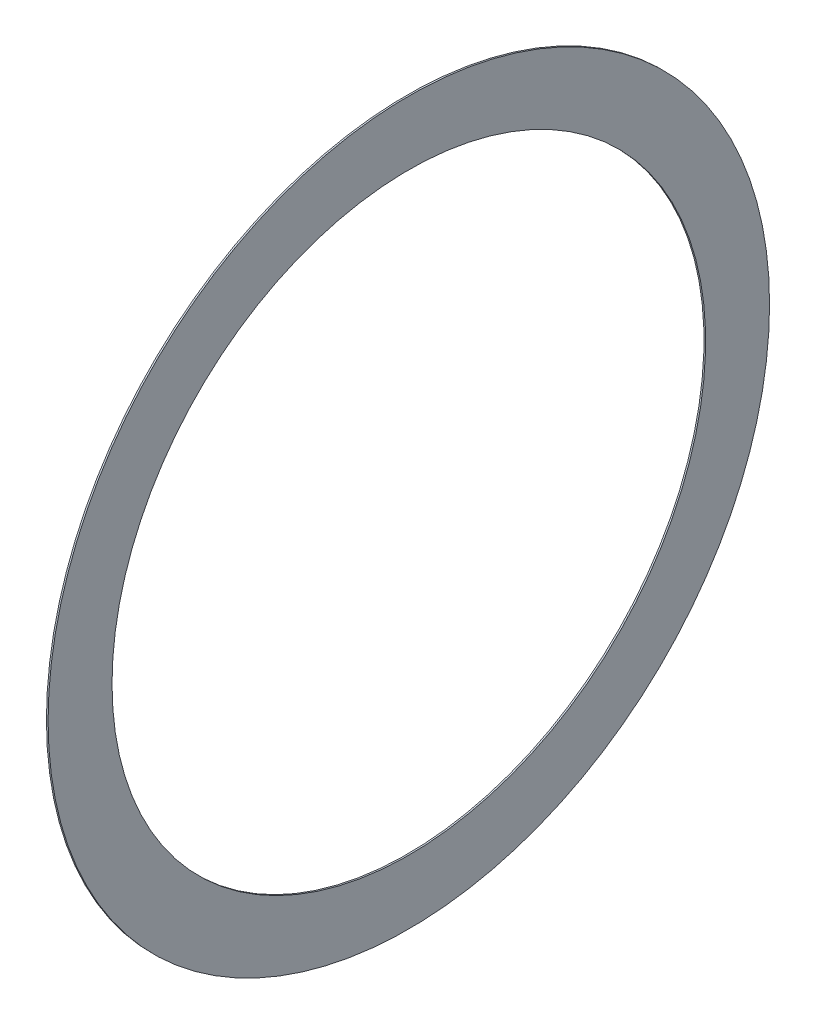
from build123d import *

# Parameters (mm, degrees)
ESQUISSE1_W = 0.25
ESQUISSE1_H = 9.75


with BuildPart() as part:
    # Esquisse1 → R_volution1 (revolve)
    with BuildSketch(Plane.XY, mode=Mode.PRIVATE) as r_volution1_sk:
        with Locations((0.125, 50.125)):
            Rectangle(ESQUISSE1_W, ESQUISSE1_H)
    revolve(r_volution1_sk.sketch.rotate(Axis((0, 0, 0), (1, 0, 0)), 90), axis=Axis((0, 0, 0), (1, 0, 0)))


solid = part.part
